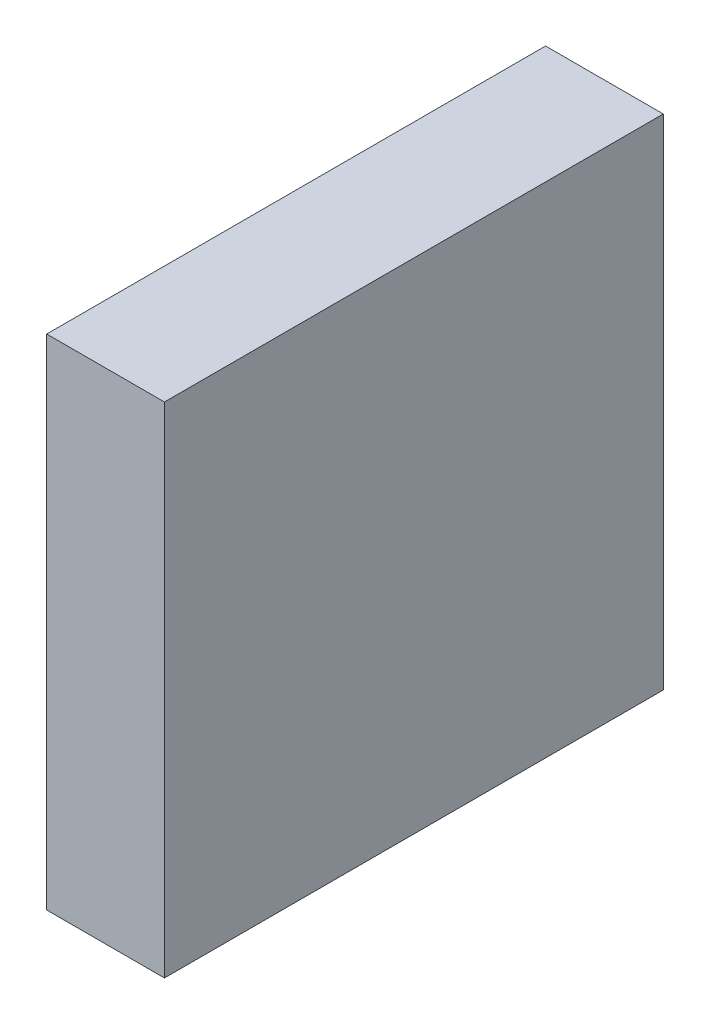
ISO-10303-21;
HEADER;
FILE_DESCRIPTION(('STEP AP214'),'2;1');
FILE_NAME('part.step','',(''),(''),'','','');
FILE_SCHEMA(('AUTOMOTIVE_DESIGN { 1 0 10303 214 1 1 1 1 }'));
ENDSEC;
DATA;
#1=APPLICATION_CONTEXT('core data for automotive mechanical design processes');
#2=APPLICATION_PROTOCOL_DEFINITION('international standard','automotive_design',2000,#1);
#3=PRODUCT_CONTEXT('',#1,'mechanical');
#4=PRODUCT('Part','Part','',(#3));
#5=PRODUCT_RELATED_PRODUCT_CATEGORY('part','',(#4));
#6=PRODUCT_DEFINITION_FORMATION('','',#4);
#7=PRODUCT_DEFINITION_CONTEXT('part definition',#1,'design');
#8=PRODUCT_DEFINITION('design','',#6,#7);
#9=PRODUCT_DEFINITION_SHAPE('','',#8);
#10=(LENGTH_UNIT() NAMED_UNIT(*) SI_UNIT(.MILLI.,.METRE.));
#11=(NAMED_UNIT(*) PLANE_ANGLE_UNIT() SI_UNIT($,.RADIAN.));
#12=(NAMED_UNIT(*) SI_UNIT($,.STERADIAN.) SOLID_ANGLE_UNIT());
#13=UNCERTAINTY_MEASURE_WITH_UNIT(LENGTH_MEASURE(1.E-05),#10,'distance_accuracy_value','');
#14=(GEOMETRIC_REPRESENTATION_CONTEXT(3) GLOBAL_UNCERTAINTY_ASSIGNED_CONTEXT((#13)) GLOBAL_UNIT_ASSIGNED_CONTEXT((#10,
#11,#12)) REPRESENTATION_CONTEXT('',''));
#15=CARTESIAN_POINT('',(0.,0.,0.));
#16=DIRECTION('',(0.,0.,1.));
#17=DIRECTION('',(1.,0.,0.));
#18=AXIS2_PLACEMENT_3D('',#15,#16,#17);
#19=CARTESIAN_POINT('',(5.9944,0.,0.));
#20=DIRECTION('',(0.,0.,-1.));
#21=DIRECTION('',(-1.,0.,0.));
#22=AXIS2_PLACEMENT_3D('',#19,#20,#21);
#23=PLANE('',#22);
#24=DIRECTION('',(0.,-1.,0.));
#25=VECTOR('',#24,1.);
#26=CARTESIAN_POINT('',(0.,0.,0.));
#27=LINE('',#26,#25);
#28=CARTESIAN_POINT('',(0.,25.4,0.));
#29=VERTEX_POINT('',#28);
#30=CARTESIAN_POINT('',(0.,0.,0.));
#31=VERTEX_POINT('',#30);
#32=EDGE_CURVE('E74',#29,#31,#27,.T.);
#33=ORIENTED_EDGE('',*,*,#32,.T.);
#34=DIRECTION('',(-1.,0.,0.));
#35=VECTOR('',#34,1.);
#36=CARTESIAN_POINT('',(5.9944,0.,0.));
#37=LINE('',#36,#35);
#38=CARTESIAN_POINT('',(5.9944,0.,0.));
#39=VERTEX_POINT('',#38);
#40=EDGE_CURVE('E11',#39,#31,#37,.T.);
#41=ORIENTED_EDGE('',*,*,#40,.F.);
#42=DIRECTION('',(0.,-1.,0.));
#43=VECTOR('',#42,1.);
#44=CARTESIAN_POINT('',(5.9944,0.,0.));
#45=LINE('',#44,#43);
#46=CARTESIAN_POINT('',(5.9944,25.4,0.));
#47=VERTEX_POINT('',#46);
#48=EDGE_CURVE('E92',#47,#39,#45,.T.);
#49=ORIENTED_EDGE('',*,*,#48,.F.);
#50=DIRECTION('',(-1.,0.,0.));
#51=VECTOR('',#50,1.);
#52=CARTESIAN_POINT('',(5.9944,25.4,0.));
#53=LINE('',#52,#51);
#54=EDGE_CURVE('E86',#47,#29,#53,.T.);
#55=ORIENTED_EDGE('',*,*,#54,.T.);
#56=EDGE_LOOP('',(#33,#41,#49,#55));
#57=FACE_BOUND('',#56,.T.);
#58=ADVANCED_FACE('F30',(#57),#23,.F.);
#59=CARTESIAN_POINT('',(5.9944,0.,0.));
#60=DIRECTION('',(0.,1.,0.));
#61=DIRECTION('',(0.,0.,1.));
#62=AXIS2_PLACEMENT_3D('',#59,#60,#61);
#63=PLANE('',#62);
#64=DIRECTION('',(0.,0.,-1.));
#65=VECTOR('',#64,1.);
#66=CARTESIAN_POINT('',(0.,0.,0.));
#67=LINE('',#66,#65);
#68=CARTESIAN_POINT('',(0.,0.,-25.4));
#69=VERTEX_POINT('',#68);
#70=EDGE_CURVE('E70',#31,#69,#67,.T.);
#71=ORIENTED_EDGE('',*,*,#70,.T.);
#72=DIRECTION('',(-1.,0.,0.));
#73=VECTOR('',#72,1.);
#74=CARTESIAN_POINT('',(5.9944,0.,-25.4));
#75=LINE('',#74,#73);
#76=CARTESIAN_POINT('',(5.9944,0.,-25.4));
#77=VERTEX_POINT('',#76);
#78=EDGE_CURVE('E37',#77,#69,#75,.T.);
#79=ORIENTED_EDGE('',*,*,#78,.F.);
#80=DIRECTION('',(0.,0.,-1.));
#81=VECTOR('',#80,1.);
#82=CARTESIAN_POINT('',(5.9944,0.,0.));
#83=LINE('',#82,#81);
#84=EDGE_CURVE('E82',#39,#77,#83,.T.);
#85=ORIENTED_EDGE('',*,*,#84,.F.);
#86=ORIENTED_EDGE('',*,*,#40,.T.);
#87=EDGE_LOOP('',(#71,#79,#85,#86));
#88=FACE_BOUND('',#87,.T.);
#89=ADVANCED_FACE('F81',(#88),#63,.F.);
#90=CARTESIAN_POINT('',(5.9944,0.,-25.4));
#91=DIRECTION('',(0.,0.,1.));
#92=DIRECTION('',(1.,0.,0.));
#93=AXIS2_PLACEMENT_3D('',#90,#91,#92);
#94=PLANE('',#93);
#95=DIRECTION('',(0.,1.,0.));
#96=VECTOR('',#95,1.);
#97=CARTESIAN_POINT('',(0.,0.,-25.4));
#98=LINE('',#97,#96);
#99=CARTESIAN_POINT('',(0.,25.4,-25.4));
#100=VERTEX_POINT('',#99);
#101=EDGE_CURVE('E75',#69,#100,#98,.T.);
#102=ORIENTED_EDGE('',*,*,#101,.T.);
#103=DIRECTION('',(-1.,0.,0.));
#104=VECTOR('',#103,1.);
#105=CARTESIAN_POINT('',(5.9944,25.4,-25.4));
#106=LINE('',#105,#104);
#107=CARTESIAN_POINT('',(5.9944,25.4,-25.4));
#108=VERTEX_POINT('',#107);
#109=EDGE_CURVE('E98',#108,#100,#106,.T.);
#110=ORIENTED_EDGE('',*,*,#109,.F.);
#111=DIRECTION('',(0.,1.,0.));
#112=VECTOR('',#111,1.);
#113=CARTESIAN_POINT('',(5.9944,0.,-25.4));
#114=LINE('',#113,#112);
#115=EDGE_CURVE('E49',#77,#108,#114,.T.);
#116=ORIENTED_EDGE('',*,*,#115,.F.);
#117=ORIENTED_EDGE('',*,*,#78,.T.);
#118=EDGE_LOOP('',(#102,#110,#116,#117));
#119=FACE_BOUND('',#118,.T.);
#120=ADVANCED_FACE('F101',(#119),#94,.F.);
#121=CARTESIAN_POINT('',(5.9944,25.4,0.));
#122=DIRECTION('',(0.,-1.,0.));
#123=DIRECTION('',(0.,0.,-1.));
#124=AXIS2_PLACEMENT_3D('',#121,#122,#123);
#125=PLANE('',#124);
#126=DIRECTION('',(0.,0.,1.));
#127=VECTOR('',#126,1.);
#128=CARTESIAN_POINT('',(0.,25.4,0.));
#129=LINE('',#128,#127);
#130=EDGE_CURVE('E90',#100,#29,#129,.T.);
#131=ORIENTED_EDGE('',*,*,#130,.T.);
#132=ORIENTED_EDGE('',*,*,#54,.F.);
#133=DIRECTION('',(0.,0.,1.));
#134=VECTOR('',#133,1.);
#135=CARTESIAN_POINT('',(5.9944,25.4,0.));
#136=LINE('',#135,#134);
#137=EDGE_CURVE('E44',#108,#47,#136,.T.);
#138=ORIENTED_EDGE('',*,*,#137,.F.);
#139=ORIENTED_EDGE('',*,*,#109,.T.);
#140=EDGE_LOOP('',(#131,#132,#138,#139));
#141=FACE_BOUND('',#140,.T.);
#142=ADVANCED_FACE('F103',(#141),#125,.F.);
#143=CARTESIAN_POINT('',(5.9944,25.4,0.));
#144=DIRECTION('',(-1.,0.,0.));
#145=DIRECTION('',(0.,0.,1.));
#146=AXIS2_PLACEMENT_3D('',#143,#144,#145);
#147=PLANE('',#146);
#148=ORIENTED_EDGE('',*,*,#48,.T.);
#149=ORIENTED_EDGE('',*,*,#84,.T.);
#150=ORIENTED_EDGE('',*,*,#115,.T.);
#151=ORIENTED_EDGE('',*,*,#137,.T.);
#152=EDGE_LOOP('',(#148,#149,#150,#151));
#153=FACE_BOUND('',#152,.T.);
#154=ADVANCED_FACE('F104',(#153),#147,.F.);
#155=CARTESIAN_POINT('',(0.,25.4,0.));
#156=DIRECTION('',(-1.,0.,0.));
#157=DIRECTION('',(0.,0.,1.));
#158=AXIS2_PLACEMENT_3D('',#155,#156,#157);
#159=PLANE('',#158);
#160=ORIENTED_EDGE('',*,*,#32,.F.);
#161=ORIENTED_EDGE('',*,*,#130,.F.);
#162=ORIENTED_EDGE('',*,*,#101,.F.);
#163=ORIENTED_EDGE('',*,*,#70,.F.);
#164=EDGE_LOOP('',(#160,#161,#162,#163));
#165=FACE_BOUND('',#164,.T.);
#166=ADVANCED_FACE('F71',(#165),#159,.T.);
#167=CLOSED_SHELL('',(#58,#89,#120,#142,#154,#166));
#168=MANIFOLD_SOLID_BREP('B2',#167);
#169=ADVANCED_BREP_SHAPE_REPRESENTATION('',(#18,#168),#14);
#170=SHAPE_DEFINITION_REPRESENTATION(#9,#169);
ENDSEC;
END-ISO-10303-21;
